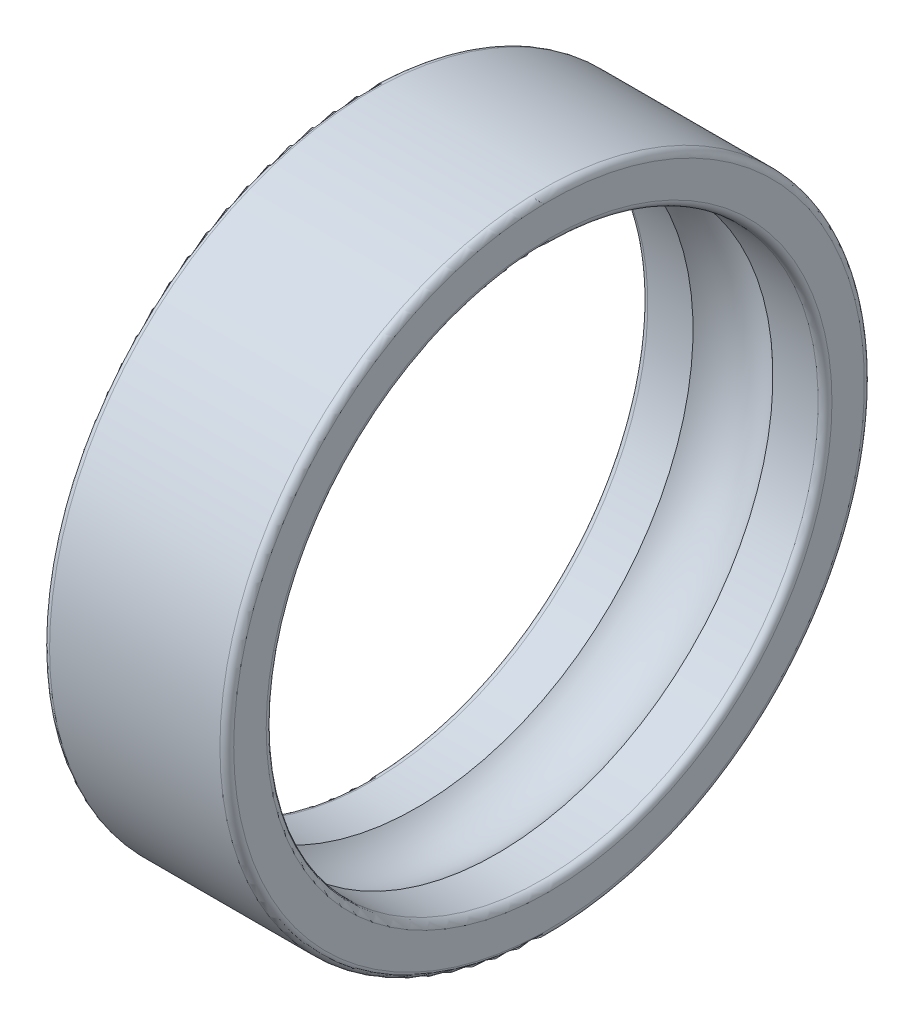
from build123d import *


with BuildPart() as part:
    # Esquisse1 → Base-R_volution (revolve)
    with BuildSketch(Plane.XY, mode=Mode.PRIVATE) as base_r_volution_sk:
        with BuildLine():
            Line((0, 13.7), (0, 12.289477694))
            ThreePointArc((0, 12.289477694), (-0.087867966, 12.077345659), (-0.3, 11.989477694))
            Line((-0.3, 11.989477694), (-2.265064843, 11.989477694))
            ThreePointArc((-2.265064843, 11.989477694), (-4, 12.689477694), (-5.734935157, 11.989477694))
            Line((-5.734935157, 11.989477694), (-7.7, 11.989477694))
            ThreePointArc((-7.7, 11.989477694), (-7.912132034, 12.077345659), (-8, 12.289477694))
            Line((-8, 12.289477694), (-8, 13.7))
            ThreePointArc((-8, 13.7), (-7.912132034, 13.912132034), (-7.7, 14))
            Line((-7.7, 14), (-0.3, 14))
            ThreePointArc((-0.3, 14), (-0.087867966, 13.912132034), (0, 13.7))
        make_face()
    revolve(base_r_volution_sk.sketch.rotate(Axis((-60, 0, 0), (1, 0, 0)), 90), axis=Axis((-60, 0, 0), (1, 0, 0)))


solid = part.part
